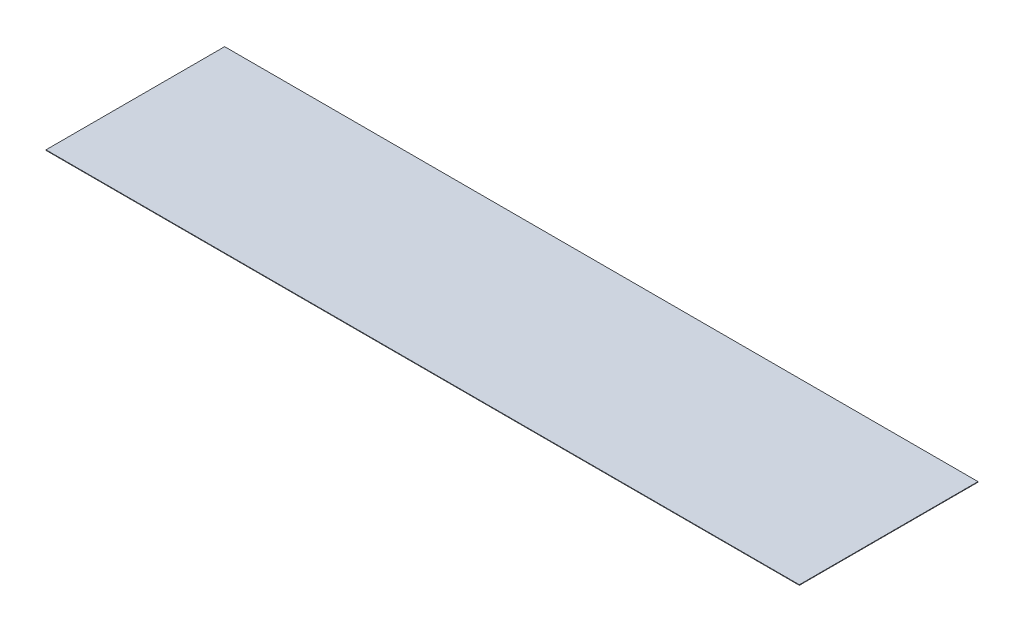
from build123d import *

# Parameters (mm, degrees)
SKETCH1_W           = 4217
SKETCH1_H           = 1000
BOSS_EXTRUDE1_DEPTH = 3


with BuildPart() as part:
    # Sketch1 → Boss-Extrude1 (new body)
    with BuildSketch(Plane(origin=(0, 0, 0), x_dir=(1, 0, 0), z_dir=(0, 1, 0))):
        Rectangle(SKETCH1_W, SKETCH1_H)
    extrude(amount=BOSS_EXTRUDE1_DEPTH)


solid = part.part
